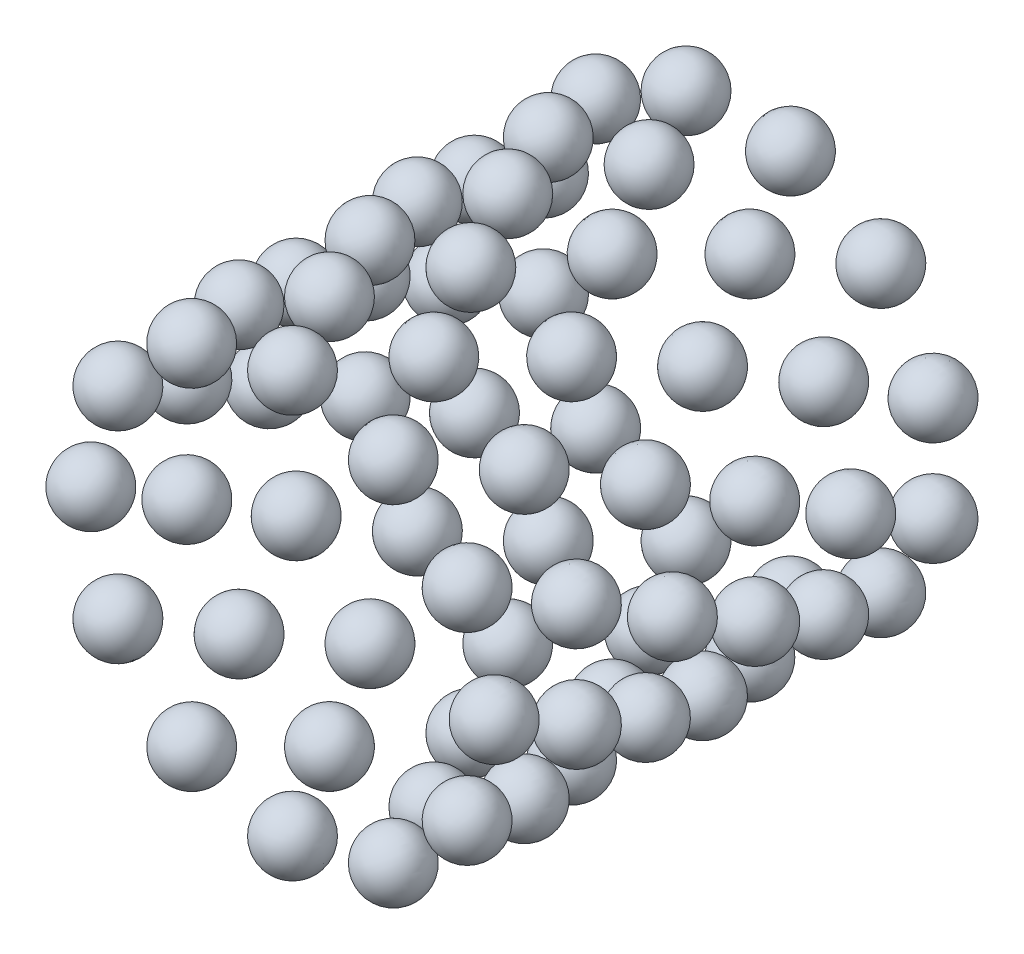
ISO-10303-21;
HEADER;
FILE_DESCRIPTION(('STEP AP214'),'2;1');
FILE_NAME('part.step','',(''),(''),'','','');
FILE_SCHEMA(('AUTOMOTIVE_DESIGN { 1 0 10303 214 1 1 1 1 }'));
ENDSEC;
DATA;
#1=APPLICATION_CONTEXT('core data for automotive mechanical design processes');
#2=APPLICATION_PROTOCOL_DEFINITION('international standard','automotive_design',2000,#1);
#3=PRODUCT_CONTEXT('',#1,'mechanical');
#4=PRODUCT('Part','Part','',(#3));
#5=PRODUCT_RELATED_PRODUCT_CATEGORY('part','',(#4));
#6=PRODUCT_DEFINITION_FORMATION('','',#4);
#7=PRODUCT_DEFINITION_CONTEXT('part definition',#1,'design');
#8=PRODUCT_DEFINITION('design','',#6,#7);
#9=PRODUCT_DEFINITION_SHAPE('','',#8);
#10=(LENGTH_UNIT() NAMED_UNIT(*) SI_UNIT(.MILLI.,.METRE.));
#11=(NAMED_UNIT(*) PLANE_ANGLE_UNIT() SI_UNIT($,.RADIAN.));
#12=(NAMED_UNIT(*) SI_UNIT($,.STERADIAN.) SOLID_ANGLE_UNIT());
#13=UNCERTAINTY_MEASURE_WITH_UNIT(LENGTH_MEASURE(1.E-05),#10,'distance_accuracy_value','');
#14=(GEOMETRIC_REPRESENTATION_CONTEXT(3) GLOBAL_UNCERTAINTY_ASSIGNED_CONTEXT((#13)) GLOBAL_UNIT_ASSIGNED_CONTEXT((#10,
#11,#12)) REPRESENTATION_CONTEXT('',''));
#15=CARTESIAN_POINT('',(0.,0.,0.));
#16=DIRECTION('',(0.,0.,1.));
#17=DIRECTION('',(1.,0.,0.));
#18=AXIS2_PLACEMENT_3D('',#15,#16,#17);
#19=CARTESIAN_POINT('',(-8.22724133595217,-4.75,-8.4));
#20=DIRECTION('',(-0.866025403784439,-0.5,0.));
#21=DIRECTION('',(0.5,-0.866025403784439,0.));
#22=AXIS2_PLACEMENT_3D('',#19,#20,#21);
#23=SPHERICAL_SURFACE('',#22,1.5);
#24=CARTESIAN_POINT('',(-9.52627944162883,-5.5,-8.4));
#25=VERTEX_POINT('',#24);
#26=VERTEX_LOOP('',#25);
#27=FACE_BOUND('',#26,.T.);
#28=CARTESIAN_POINT('',(-6.92820323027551,-4.,-8.4));
#29=VERTEX_POINT('',#28);
#30=VERTEX_LOOP('',#29);
#31=FACE_BOUND('',#30,.T.);
#32=ADVANCED_FACE('P0_F16',(#27,#31),#23,.T.);
#33=CLOSED_SHELL('',(#32));
#34=MANIFOLD_SOLID_BREP('P0_B1',#33);
#35=CARTESIAN_POINT('',(8.22724133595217,-4.75,0.));
#36=DIRECTION('',(0.866025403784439,-0.5,0.));
#37=DIRECTION('',(0.5,0.866025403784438,0.));
#38=AXIS2_PLACEMENT_3D('',#35,#36,#37);
#39=SPHERICAL_SURFACE('',#38,1.5);
#40=CARTESIAN_POINT('',(9.52627944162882,-5.5,0.));
#41=VERTEX_POINT('',#40);
#42=VERTEX_LOOP('',#41);
#43=FACE_BOUND('',#42,.T.);
#44=CARTESIAN_POINT('',(6.92820323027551,-4.,0.));
#45=VERTEX_POINT('',#44);
#46=VERTEX_LOOP('',#45);
#47=FACE_BOUND('',#46,.T.);
#48=ADVANCED_FACE('P1_F16',(#43,#47),#39,.T.);
#49=CLOSED_SHELL('',(#48));
#50=MANIFOLD_SOLID_BREP('P1_B1',#49);
#51=CARTESIAN_POINT('',(-9.5,0.,-16.8));
#52=DIRECTION('',(-1.,0.,0.));
#53=DIRECTION('',(0.,-1.,0.));
#54=AXIS2_PLACEMENT_3D('',#51,#52,#53);
#55=SPHERICAL_SURFACE('',#54,1.5);
#56=CARTESIAN_POINT('',(-11.,0.,-16.8));
#57=VERTEX_POINT('',#56);
#58=VERTEX_LOOP('',#57);
#59=FACE_BOUND('',#58,.T.);
#60=CARTESIAN_POINT('',(-8.,0.,-16.8));
#61=VERTEX_POINT('',#60);
#62=VERTEX_LOOP('',#61);
#63=FACE_BOUND('',#62,.T.);
#64=ADVANCED_FACE('P2_F16',(#59,#63),#55,.T.);
#65=CLOSED_SHELL('',(#64));
#66=MANIFOLD_SOLID_BREP('P2_B1',#65);
#67=CARTESIAN_POINT('',(-8.22724133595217,4.75,-16.8));
#68=DIRECTION('',(-0.866025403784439,0.5,0.));
#69=DIRECTION('',(-0.5,-0.866025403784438,0.));
#70=AXIS2_PLACEMENT_3D('',#67,#68,#69);
#71=SPHERICAL_SURFACE('',#70,1.5);
#72=CARTESIAN_POINT('',(-9.52627944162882,5.5,-16.8));
#73=VERTEX_POINT('',#72);
#74=VERTEX_LOOP('',#73);
#75=FACE_BOUND('',#74,.T.);
#76=CARTESIAN_POINT('',(-6.92820323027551,4.,-16.8));
#77=VERTEX_POINT('',#76);
#78=VERTEX_LOOP('',#77);
#79=FACE_BOUND('',#78,.T.);
#80=ADVANCED_FACE('P3_F16',(#75,#79),#71,.T.);
#81=CLOSED_SHELL('',(#80));
#82=MANIFOLD_SOLID_BREP('P3_B1',#81);
#83=CARTESIAN_POINT('',(0.,9.5,-16.8));
#84=DIRECTION('',(0.,1.,0.));
#85=DIRECTION('',(-1.,0.,0.));
#86=AXIS2_PLACEMENT_3D('',#83,#84,#85);
#87=SPHERICAL_SURFACE('',#86,1.5);
#88=CARTESIAN_POINT('',(0.,11.,-16.8));
#89=VERTEX_POINT('',#88);
#90=VERTEX_LOOP('',#89);
#91=FACE_BOUND('',#90,.T.);
#92=CARTESIAN_POINT('',(0.,8.,-16.8));
#93=VERTEX_POINT('',#92);
#94=VERTEX_LOOP('',#93);
#95=FACE_BOUND('',#94,.T.);
#96=ADVANCED_FACE('P4_F16',(#91,#95),#87,.T.);
#97=CLOSED_SHELL('',(#96));
#98=MANIFOLD_SOLID_BREP('P4_B1',#97);
#99=CARTESIAN_POINT('',(-9.5,0.,-8.4));
#100=DIRECTION('',(-1.,0.,0.));
#101=DIRECTION('',(0.,-1.,0.));
#102=AXIS2_PLACEMENT_3D('',#99,#100,#101);
#103=SPHERICAL_SURFACE('',#102,1.5);
#104=CARTESIAN_POINT('',(-11.,0.,-8.4));
#105=VERTEX_POINT('',#104);
#106=VERTEX_LOOP('',#105);
#107=FACE_BOUND('',#106,.T.);
#108=CARTESIAN_POINT('',(-8.,0.,-8.4));
#109=VERTEX_POINT('',#108);
#110=VERTEX_LOOP('',#109);
#111=FACE_BOUND('',#110,.T.);
#112=ADVANCED_FACE('P5_F16',(#107,#111),#103,.T.);
#113=CLOSED_SHELL('',(#112));
#114=MANIFOLD_SOLID_BREP('P5_B1',#113);
#115=CARTESIAN_POINT('',(4.75,8.22724133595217,-16.8));
#116=DIRECTION('',(0.5,0.866025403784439,0.));
#117=DIRECTION('',(-0.866025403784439,0.5,0.));
#118=AXIS2_PLACEMENT_3D('',#115,#116,#117);
#119=SPHERICAL_SURFACE('',#118,1.5);
#120=CARTESIAN_POINT('',(5.5,9.52627944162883,-16.8));
#121=VERTEX_POINT('',#120);
#122=VERTEX_LOOP('',#121);
#123=FACE_BOUND('',#122,.T.);
#124=CARTESIAN_POINT('',(4.,6.92820323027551,-16.8));
#125=VERTEX_POINT('',#124);
#126=VERTEX_LOOP('',#125);
#127=FACE_BOUND('',#126,.T.);
#128=ADVANCED_FACE('P6_F16',(#123,#127),#119,.T.);
#129=CLOSED_SHELL('',(#128));
#130=MANIFOLD_SOLID_BREP('P6_B1',#129);
#131=CARTESIAN_POINT('',(-2.45878092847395,-9.17629534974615,-21.));
#132=DIRECTION('',(-0.5,-0.866025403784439,0.));
#133=DIRECTION('',(0.866025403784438,-0.5,0.));
#134=AXIS2_PLACEMENT_3D('',#131,#132,#133);
#135=SPHERICAL_SURFACE('',#134,1.5);
#136=CARTESIAN_POINT('',(-3.20878092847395,-10.4753334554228,-21.));
#137=VERTEX_POINT('',#136);
#138=VERTEX_LOOP('',#137);
#139=FACE_BOUND('',#138,.T.);
#140=CARTESIAN_POINT('',(-1.70878092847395,-7.87725724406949,-21.));
#141=VERTEX_POINT('',#140);
#142=VERTEX_LOOP('',#141);
#143=FACE_BOUND('',#142,.T.);
#144=ADVANCED_FACE('P7_F16',(#139,#143),#135,.T.);
#145=CLOSED_SHELL('',(#144));
#146=MANIFOLD_SOLID_BREP('P7_B1',#145);
#147=CARTESIAN_POINT('',(6.7175144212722,6.7175144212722,-21.));
#148=DIRECTION('',(0.866025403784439,0.5,0.));
#149=DIRECTION('',(-0.5,0.866025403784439,0.));
#150=AXIS2_PLACEMENT_3D('',#147,#148,#149);
#151=SPHERICAL_SURFACE('',#150,1.5);
#152=CARTESIAN_POINT('',(8.01655252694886,7.46751442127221,-21.));
#153=VERTEX_POINT('',#152);
#154=VERTEX_LOOP('',#153);
#155=FACE_BOUND('',#154,.T.);
#156=CARTESIAN_POINT('',(5.41847631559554,5.96751442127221,-21.));
#157=VERTEX_POINT('',#156);
#158=VERTEX_LOOP('',#157);
#159=FACE_BOUND('',#158,.T.);
#160=ADVANCED_FACE('P8_F16',(#155,#159),#151,.T.);
#161=CLOSED_SHELL('',(#160));
#162=MANIFOLD_SOLID_BREP('P8_B1',#161);
#163=CARTESIAN_POINT('',(-8.22724133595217,-4.75,0.));
#164=DIRECTION('',(-0.866025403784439,-0.5,0.));
#165=DIRECTION('',(0.5,-0.866025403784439,0.));
#166=AXIS2_PLACEMENT_3D('',#163,#164,#165);
#167=SPHERICAL_SURFACE('',#166,1.5);
#168=CARTESIAN_POINT('',(-9.52627944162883,-5.5,0.));
#169=VERTEX_POINT('',#168);
#170=VERTEX_LOOP('',#169);
#171=FACE_BOUND('',#170,.T.);
#172=CARTESIAN_POINT('',(-6.92820323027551,-4.,0.));
#173=VERTEX_POINT('',#172);
#174=VERTEX_LOOP('',#173);
#175=FACE_BOUND('',#174,.T.);
#176=ADVANCED_FACE('P9_F16',(#171,#175),#167,.T.);
#177=CLOSED_SHELL('',(#176));
#178=MANIFOLD_SOLID_BREP('P9_B1',#177);
#179=CARTESIAN_POINT('',(6.7175144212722,-6.71751442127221,-12.6));
#180=DIRECTION('',(0.499999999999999,-0.866025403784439,0.));
#181=DIRECTION('',(0.866025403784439,0.499999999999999,0.));
#182=AXIS2_PLACEMENT_3D('',#179,#180,#181);
#183=SPHERICAL_SURFACE('',#182,1.5);
#184=CARTESIAN_POINT('',(7.4675144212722,-8.01655252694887,-12.6));
#185=VERTEX_POINT('',#184);
#186=VERTEX_LOOP('',#185);
#187=FACE_BOUND('',#186,.T.);
#188=CARTESIAN_POINT('',(5.9675144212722,-5.41847631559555,-12.6));
#189=VERTEX_POINT('',#188);
#190=VERTEX_LOOP('',#189);
#191=FACE_BOUND('',#190,.T.);
#192=ADVANCED_FACE('P10_F16',(#187,#191),#183,.T.);
#193=CLOSED_SHELL('',(#192));
#194=MANIFOLD_SOLID_BREP('P10_B1',#193);
#195=CARTESIAN_POINT('',(8.22724133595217,4.75,-16.8));
#196=DIRECTION('',(0.866025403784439,0.5,0.));
#197=DIRECTION('',(-0.5,0.866025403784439,0.));
#198=AXIS2_PLACEMENT_3D('',#195,#196,#197);
#199=SPHERICAL_SURFACE('',#198,1.5);
#200=CARTESIAN_POINT('',(9.52627944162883,5.5,-16.8));
#201=VERTEX_POINT('',#200);
#202=VERTEX_LOOP('',#201);
#203=FACE_BOUND('',#202,.T.);
#204=CARTESIAN_POINT('',(6.92820323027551,4.,-16.8));
#205=VERTEX_POINT('',#204);
#206=VERTEX_LOOP('',#205);
#207=FACE_BOUND('',#206,.T.);
#208=ADVANCED_FACE('P11_F16',(#203,#207),#199,.T.);
#209=CLOSED_SHELL('',(#208));
#210=MANIFOLD_SOLID_BREP('P11_B1',#209);
#211=CARTESIAN_POINT('',(0.,-9.5,-16.8));
#212=DIRECTION('',(0.,-1.,0.));
#213=DIRECTION('',(1.,0.,0.));
#214=AXIS2_PLACEMENT_3D('',#211,#212,#213);
#215=SPHERICAL_SURFACE('',#214,1.5);
#216=CARTESIAN_POINT('',(0.,-11.,-16.8));
#217=VERTEX_POINT('',#216);
#218=VERTEX_LOOP('',#217);
#219=FACE_BOUND('',#218,.T.);
#220=CARTESIAN_POINT('',(0.,-8.,-16.8));
#221=VERTEX_POINT('',#220);
#222=VERTEX_LOOP('',#221);
#223=FACE_BOUND('',#222,.T.);
#224=ADVANCED_FACE('P12_F16',(#219,#223),#215,.T.);
#225=CLOSED_SHELL('',(#224));
#226=MANIFOLD_SOLID_BREP('P12_B1',#225);
#227=CARTESIAN_POINT('',(2.45878092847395,-9.17629534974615,-4.2));
#228=DIRECTION('',(0.,-1.,0.));
#229=DIRECTION('',(1.,0.,0.));
#230=AXIS2_PLACEMENT_3D('',#227,#228,#229);
#231=SPHERICAL_SURFACE('',#230,1.5);
#232=CARTESIAN_POINT('',(2.45878092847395,-10.6762953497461,-4.2));
#233=VERTEX_POINT('',#232);
#234=VERTEX_LOOP('',#233);
#235=FACE_BOUND('',#234,.T.);
#236=CARTESIAN_POINT('',(2.45878092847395,-7.67629534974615,-4.2));
#237=VERTEX_POINT('',#236);
#238=VERTEX_LOOP('',#237);
#239=FACE_BOUND('',#238,.T.);
#240=ADVANCED_FACE('P13_F16',(#235,#239),#231,.T.);
#241=CLOSED_SHELL('',(#240));
#242=MANIFOLD_SOLID_BREP('P13_B1',#241);
#243=CARTESIAN_POINT('',(-9.17629534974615,-2.45878092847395,-4.2));
#244=DIRECTION('',(-1.,0.,0.));
#245=DIRECTION('',(0.,-1.,0.));
#246=AXIS2_PLACEMENT_3D('',#243,#244,#245);
#247=SPHERICAL_SURFACE('',#246,1.5);
#248=CARTESIAN_POINT('',(-10.6762953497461,-2.45878092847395,-4.2));
#249=VERTEX_POINT('',#248);
#250=VERTEX_LOOP('',#249);
#251=FACE_BOUND('',#250,.T.);
#252=CARTESIAN_POINT('',(-7.67629534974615,-2.45878092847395,-4.2));
#253=VERTEX_POINT('',#252);
#254=VERTEX_LOOP('',#253);
#255=FACE_BOUND('',#254,.T.);
#256=ADVANCED_FACE('P14_F16',(#251,#255),#247,.T.);
#257=CLOSED_SHELL('',(#256));
#258=MANIFOLD_SOLID_BREP('P14_B1',#257);
#259=CARTESIAN_POINT('',(9.17629534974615,-2.45878092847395,-12.6));
#260=DIRECTION('',(0.866025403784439,-0.5,0.));
#261=DIRECTION('',(0.5,0.866025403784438,0.));
#262=AXIS2_PLACEMENT_3D('',#259,#260,#261);
#263=SPHERICAL_SURFACE('',#262,1.5);
#264=CARTESIAN_POINT('',(10.4753334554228,-3.20878092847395,-12.6));
#265=VERTEX_POINT('',#264);
#266=VERTEX_LOOP('',#265);
#267=FACE_BOUND('',#266,.T.);
#268=CARTESIAN_POINT('',(7.87725724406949,-1.70878092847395,-12.6));
#269=VERTEX_POINT('',#268);
#270=VERTEX_LOOP('',#269);
#271=FACE_BOUND('',#270,.T.);
#272=ADVANCED_FACE('P15_F16',(#267,#271),#263,.T.);
#273=CLOSED_SHELL('',(#272));
#274=MANIFOLD_SOLID_BREP('P15_B1',#273);
#275=CARTESIAN_POINT('',(9.17629534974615,2.45878092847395,-21.));
#276=DIRECTION('',(1.,0.,0.));
#277=DIRECTION('',(0.,1.,0.));
#278=AXIS2_PLACEMENT_3D('',#275,#276,#277);
#279=SPHERICAL_SURFACE('',#278,1.5);
#280=CARTESIAN_POINT('',(10.6762953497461,2.45878092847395,-21.));
#281=VERTEX_POINT('',#280);
#282=VERTEX_LOOP('',#281);
#283=FACE_BOUND('',#282,.T.);
#284=CARTESIAN_POINT('',(7.67629534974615,2.45878092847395,-21.));
#285=VERTEX_POINT('',#284);
#286=VERTEX_LOOP('',#285);
#287=FACE_BOUND('',#286,.T.);
#288=ADVANCED_FACE('P16_F16',(#283,#287),#279,.T.);
#289=CLOSED_SHELL('',(#288));
#290=MANIFOLD_SOLID_BREP('P16_B1',#289);
#291=CARTESIAN_POINT('',(4.75,-8.22724133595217,0.));
#292=DIRECTION('',(0.499999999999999,-0.866025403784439,0.));
#293=DIRECTION('',(0.866025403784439,0.499999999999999,0.));
#294=AXIS2_PLACEMENT_3D('',#291,#292,#293);
#295=SPHERICAL_SURFACE('',#294,1.5);
#296=CARTESIAN_POINT('',(5.49999999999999,-9.52627944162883,0.));
#297=VERTEX_POINT('',#296);
#298=VERTEX_LOOP('',#297);
#299=FACE_BOUND('',#298,.T.);
#300=CARTESIAN_POINT('',(4.,-6.92820323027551,0.));
#301=VERTEX_POINT('',#300);
#302=VERTEX_LOOP('',#301);
#303=FACE_BOUND('',#302,.T.);
#304=ADVANCED_FACE('P17_F16',(#299,#303),#295,.T.);
#305=CLOSED_SHELL('',(#304));
#306=MANIFOLD_SOLID_BREP('P17_B1',#305);
#307=CARTESIAN_POINT('',(-4.75,-8.22724133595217,-16.8));
#308=DIRECTION('',(-0.5,-0.866025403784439,0.));
#309=DIRECTION('',(0.866025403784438,-0.5,0.));
#310=AXIS2_PLACEMENT_3D('',#307,#308,#309);
#311=SPHERICAL_SURFACE('',#310,1.5);
#312=CARTESIAN_POINT('',(-5.5,-9.52627944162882,-16.8));
#313=VERTEX_POINT('',#312);
#314=VERTEX_LOOP('',#313);
#315=FACE_BOUND('',#314,.T.);
#316=CARTESIAN_POINT('',(-4.,-6.92820323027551,-16.8));
#317=VERTEX_POINT('',#316);
#318=VERTEX_LOOP('',#317);
#319=FACE_BOUND('',#318,.T.);
#320=ADVANCED_FACE('P18_F16',(#315,#319),#311,.T.);
#321=CLOSED_SHELL('',(#320));
#322=MANIFOLD_SOLID_BREP('P18_B1',#321);
#323=CARTESIAN_POINT('',(9.17629534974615,-2.45878092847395,-21.));
#324=DIRECTION('',(0.866025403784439,-0.5,0.));
#325=DIRECTION('',(0.5,0.866025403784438,0.));
#326=AXIS2_PLACEMENT_3D('',#323,#324,#325);
#327=SPHERICAL_SURFACE('',#326,1.5);
#328=CARTESIAN_POINT('',(10.4753334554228,-3.20878092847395,-21.));
#329=VERTEX_POINT('',#328);
#330=VERTEX_LOOP('',#329);
#331=FACE_BOUND('',#330,.T.);
#332=CARTESIAN_POINT('',(7.87725724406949,-1.70878092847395,-21.));
#333=VERTEX_POINT('',#332);
#334=VERTEX_LOOP('',#333);
#335=FACE_BOUND('',#334,.T.);
#336=ADVANCED_FACE('P19_F16',(#331,#335),#327,.T.);
#337=CLOSED_SHELL('',(#336));
#338=MANIFOLD_SOLID_BREP('P19_B1',#337);
#339=CARTESIAN_POINT('',(-4.75,-8.22724133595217,0.));
#340=DIRECTION('',(-0.5,-0.866025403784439,0.));
#341=DIRECTION('',(0.866025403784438,-0.5,0.));
#342=AXIS2_PLACEMENT_3D('',#339,#340,#341);
#343=SPHERICAL_SURFACE('',#342,1.5);
#344=CARTESIAN_POINT('',(-5.5,-9.52627944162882,0.));
#345=VERTEX_POINT('',#344);
#346=VERTEX_LOOP('',#345);
#347=FACE_BOUND('',#346,.T.);
#348=CARTESIAN_POINT('',(-4.,-6.92820323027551,0.));
#349=VERTEX_POINT('',#348);
#350=VERTEX_LOOP('',#349);
#351=FACE_BOUND('',#350,.T.);
#352=ADVANCED_FACE('P20_F16',(#347,#351),#343,.T.);
#353=CLOSED_SHELL('',(#352));
#354=MANIFOLD_SOLID_BREP('P20_B1',#353);
#355=CARTESIAN_POINT('',(2.45878092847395,9.17629534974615,-4.2));
#356=DIRECTION('',(0.5,0.866025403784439,0.));
#357=DIRECTION('',(-0.866025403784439,0.5,0.));
#358=AXIS2_PLACEMENT_3D('',#355,#356,#357);
#359=SPHERICAL_SURFACE('',#358,1.5);
#360=CARTESIAN_POINT('',(3.20878092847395,10.4753334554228,-4.2));
#361=VERTEX_POINT('',#360);
#362=VERTEX_LOOP('',#361);
#363=FACE_BOUND('',#362,.T.);
#364=CARTESIAN_POINT('',(1.70878092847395,7.87725724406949,-4.2));
#365=VERTEX_POINT('',#364);
#366=VERTEX_LOOP('',#365);
#367=FACE_BOUND('',#366,.T.);
#368=ADVANCED_FACE('P21_F16',(#363,#367),#359,.T.);
#369=CLOSED_SHELL('',(#368));
#370=MANIFOLD_SOLID_BREP('P21_B1',#369);
#371=CARTESIAN_POINT('',(-2.45878092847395,9.17629534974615,-12.6));
#372=DIRECTION('',(0.,1.,0.));
#373=DIRECTION('',(-1.,0.,0.));
#374=AXIS2_PLACEMENT_3D('',#371,#372,#373);
#375=SPHERICAL_SURFACE('',#374,1.5);
#376=CARTESIAN_POINT('',(-2.45878092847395,10.6762953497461,-12.6));
#377=VERTEX_POINT('',#376);
#378=VERTEX_LOOP('',#377);
#379=FACE_BOUND('',#378,.T.);
#380=CARTESIAN_POINT('',(-2.45878092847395,7.67629534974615,-12.6));
#381=VERTEX_POINT('',#380);
#382=VERTEX_LOOP('',#381);
#383=FACE_BOUND('',#382,.T.);
#384=ADVANCED_FACE('P22_F16',(#379,#383),#375,.T.);
#385=CLOSED_SHELL('',(#384));
#386=MANIFOLD_SOLID_BREP('P22_B1',#385);
#387=CARTESIAN_POINT('',(-4.75,-8.22724133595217,-8.4));
#388=DIRECTION('',(-0.5,-0.866025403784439,0.));
#389=DIRECTION('',(0.866025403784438,-0.5,0.));
#390=AXIS2_PLACEMENT_3D('',#387,#388,#389);
#391=SPHERICAL_SURFACE('',#390,1.5);
#392=CARTESIAN_POINT('',(-5.5,-9.52627944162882,-8.4));
#393=VERTEX_POINT('',#392);
#394=VERTEX_LOOP('',#393);
#395=FACE_BOUND('',#394,.T.);
#396=CARTESIAN_POINT('',(-4.,-6.92820323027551,-8.4));
#397=VERTEX_POINT('',#396);
#398=VERTEX_LOOP('',#397);
#399=FACE_BOUND('',#398,.T.);
#400=ADVANCED_FACE('P23_F16',(#395,#399),#391,.T.);
#401=CLOSED_SHELL('',(#400));
#402=MANIFOLD_SOLID_BREP('P23_B1',#401);
#403=CARTESIAN_POINT('',(-6.7175144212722,-6.7175144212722,-21.));
#404=DIRECTION('',(-0.866025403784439,-0.5,0.));
#405=DIRECTION('',(0.5,-0.866025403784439,0.));
#406=AXIS2_PLACEMENT_3D('',#403,#404,#405);
#407=SPHERICAL_SURFACE('',#406,1.5);
#408=CARTESIAN_POINT('',(-8.01655252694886,-7.4675144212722,-21.));
#409=VERTEX_POINT('',#408);
#410=VERTEX_LOOP('',#409);
#411=FACE_BOUND('',#410,.T.);
#412=CARTESIAN_POINT('',(-5.41847631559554,-5.9675144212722,-21.));
#413=VERTEX_POINT('',#412);
#414=VERTEX_LOOP('',#413);
#415=FACE_BOUND('',#414,.T.);
#416=ADVANCED_FACE('P24_F16',(#411,#415),#407,.T.);
#417=CLOSED_SHELL('',(#416));
#418=MANIFOLD_SOLID_BREP('P24_B1',#417);
#419=CARTESIAN_POINT('',(2.45878092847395,-9.17629534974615,-21.));
#420=DIRECTION('',(0.,-1.,0.));
#421=DIRECTION('',(1.,0.,0.));
#422=AXIS2_PLACEMENT_3D('',#419,#420,#421);
#423=SPHERICAL_SURFACE('',#422,1.5);
#424=CARTESIAN_POINT('',(2.45878092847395,-10.6762953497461,-21.));
#425=VERTEX_POINT('',#424);
#426=VERTEX_LOOP('',#425);
#427=FACE_BOUND('',#426,.T.);
#428=CARTESIAN_POINT('',(2.45878092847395,-7.67629534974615,-21.));
#429=VERTEX_POINT('',#428);
#430=VERTEX_LOOP('',#429);
#431=FACE_BOUND('',#430,.T.);
#432=ADVANCED_FACE('P25_F16',(#427,#431),#423,.T.);
#433=CLOSED_SHELL('',(#432));
#434=MANIFOLD_SOLID_BREP('P25_B1',#433);
#435=CARTESIAN_POINT('',(-2.45878092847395,-9.17629534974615,-4.2));
#436=DIRECTION('',(-0.5,-0.866025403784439,0.));
#437=DIRECTION('',(0.866025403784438,-0.5,0.));
#438=AXIS2_PLACEMENT_3D('',#435,#436,#437);
#439=SPHERICAL_SURFACE('',#438,1.5);
#440=CARTESIAN_POINT('',(-3.20878092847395,-10.4753334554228,-4.2));
#441=VERTEX_POINT('',#440);
#442=VERTEX_LOOP('',#441);
#443=FACE_BOUND('',#442,.T.);
#444=CARTESIAN_POINT('',(-1.70878092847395,-7.87725724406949,-4.2));
#445=VERTEX_POINT('',#444);
#446=VERTEX_LOOP('',#445);
#447=FACE_BOUND('',#446,.T.);
#448=ADVANCED_FACE('P26_F16',(#443,#447),#439,.T.);
#449=CLOSED_SHELL('',(#448));
#450=MANIFOLD_SOLID_BREP('P26_B1',#449);
#451=CARTESIAN_POINT('',(8.22724133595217,-4.75,-16.8));
#452=DIRECTION('',(0.866025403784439,-0.5,0.));
#453=DIRECTION('',(0.5,0.866025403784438,0.));
#454=AXIS2_PLACEMENT_3D('',#451,#452,#453);
#455=SPHERICAL_SURFACE('',#454,1.5);
#456=CARTESIAN_POINT('',(9.52627944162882,-5.5,-16.8));
#457=VERTEX_POINT('',#456);
#458=VERTEX_LOOP('',#457);
#459=FACE_BOUND('',#458,.T.);
#460=CARTESIAN_POINT('',(6.92820323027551,-4.,-16.8));
#461=VERTEX_POINT('',#460);
#462=VERTEX_LOOP('',#461);
#463=FACE_BOUND('',#462,.T.);
#464=ADVANCED_FACE('P27_F16',(#459,#463),#455,.T.);
#465=CLOSED_SHELL('',(#464));
#466=MANIFOLD_SOLID_BREP('P27_B1',#465);
#467=CARTESIAN_POINT('',(9.5,0.,-16.8));
#468=DIRECTION('',(1.,0.,0.));
#469=DIRECTION('',(0.,1.,0.));
#470=AXIS2_PLACEMENT_3D('',#467,#468,#469);
#471=SPHERICAL_SURFACE('',#470,1.5);
#472=CARTESIAN_POINT('',(11.,0.,-16.8));
#473=VERTEX_POINT('',#472);
#474=VERTEX_LOOP('',#473);
#475=FACE_BOUND('',#474,.T.);
#476=CARTESIAN_POINT('',(8.,0.,-16.8));
#477=VERTEX_POINT('',#476);
#478=VERTEX_LOOP('',#477);
#479=FACE_BOUND('',#478,.T.);
#480=ADVANCED_FACE('P28_F16',(#475,#479),#471,.T.);
#481=CLOSED_SHELL('',(#480));
#482=MANIFOLD_SOLID_BREP('P28_B1',#481);
#483=CARTESIAN_POINT('',(-6.7175144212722,-6.7175144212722,-4.2));
#484=DIRECTION('',(-0.866025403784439,-0.5,0.));
#485=DIRECTION('',(0.5,-0.866025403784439,0.));
#486=AXIS2_PLACEMENT_3D('',#483,#484,#485);
#487=SPHERICAL_SURFACE('',#486,1.5);
#488=CARTESIAN_POINT('',(-8.01655252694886,-7.4675144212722,-4.2));
#489=VERTEX_POINT('',#488);
#490=VERTEX_LOOP('',#489);
#491=FACE_BOUND('',#490,.T.);
#492=CARTESIAN_POINT('',(-5.41847631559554,-5.9675144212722,-4.2));
#493=VERTEX_POINT('',#492);
#494=VERTEX_LOOP('',#493);
#495=FACE_BOUND('',#494,.T.);
#496=ADVANCED_FACE('P29_F16',(#491,#495),#487,.T.);
#497=CLOSED_SHELL('',(#496));
#498=MANIFOLD_SOLID_BREP('P29_B1',#497);
#499=CARTESIAN_POINT('',(8.22724133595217,4.75,-8.4));
#500=DIRECTION('',(0.866025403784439,0.5,0.));
#501=DIRECTION('',(-0.5,0.866025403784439,0.));
#502=AXIS2_PLACEMENT_3D('',#499,#500,#501);
#503=SPHERICAL_SURFACE('',#502,1.5);
#504=CARTESIAN_POINT('',(9.52627944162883,5.5,-8.4));
#505=VERTEX_POINT('',#504);
#506=VERTEX_LOOP('',#505);
#507=FACE_BOUND('',#506,.T.);
#508=CARTESIAN_POINT('',(6.92820323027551,4.,-8.4));
#509=VERTEX_POINT('',#508);
#510=VERTEX_LOOP('',#509);
#511=FACE_BOUND('',#510,.T.);
#512=ADVANCED_FACE('P30_F16',(#507,#511),#503,.T.);
#513=CLOSED_SHELL('',(#512));
#514=MANIFOLD_SOLID_BREP('P30_B1',#513);
#515=CARTESIAN_POINT('',(-6.7175144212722,6.7175144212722,-4.2));
#516=DIRECTION('',(-0.5,0.866025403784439,0.));
#517=DIRECTION('',(-0.866025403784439,-0.5,0.));
#518=AXIS2_PLACEMENT_3D('',#515,#516,#517);
#519=SPHERICAL_SURFACE('',#518,1.5);
#520=CARTESIAN_POINT('',(-7.4675144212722,8.01655252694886,-4.2));
#521=VERTEX_POINT('',#520);
#522=VERTEX_LOOP('',#521);
#523=FACE_BOUND('',#522,.T.);
#524=CARTESIAN_POINT('',(-5.9675144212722,5.41847631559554,-4.2));
#525=VERTEX_POINT('',#524);
#526=VERTEX_LOOP('',#525);
#527=FACE_BOUND('',#526,.T.);
#528=ADVANCED_FACE('P31_F16',(#523,#527),#519,.T.);
#529=CLOSED_SHELL('',(#528));
#530=MANIFOLD_SOLID_BREP('P31_B1',#529);
#531=CARTESIAN_POINT('',(0.,-9.5,0.));
#532=DIRECTION('',(0.,-1.,0.));
#533=DIRECTION('',(1.,0.,0.));
#534=AXIS2_PLACEMENT_3D('',#531,#532,#533);
#535=SPHERICAL_SURFACE('',#534,1.5);
#536=CARTESIAN_POINT('',(0.,-11.,0.));
#537=VERTEX_POINT('',#536);
#538=VERTEX_LOOP('',#537);
#539=FACE_BOUND('',#538,.T.);
#540=CARTESIAN_POINT('',(0.,-8.,0.));
#541=VERTEX_POINT('',#540);
#542=VERTEX_LOOP('',#541);
#543=FACE_BOUND('',#542,.T.);
#544=ADVANCED_FACE('P32_F16',(#539,#543),#535,.T.);
#545=CLOSED_SHELL('',(#544));
#546=MANIFOLD_SOLID_BREP('P32_B1',#545);
#547=CARTESIAN_POINT('',(-9.17629534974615,-2.45878092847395,-12.6));
#548=DIRECTION('',(-1.,0.,0.));
#549=DIRECTION('',(0.,-1.,0.));
#550=AXIS2_PLACEMENT_3D('',#547,#548,#549);
#551=SPHERICAL_SURFACE('',#550,1.5);
#552=CARTESIAN_POINT('',(-10.6762953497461,-2.45878092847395,-12.6));
#553=VERTEX_POINT('',#552);
#554=VERTEX_LOOP('',#553);
#555=FACE_BOUND('',#554,.T.);
#556=CARTESIAN_POINT('',(-7.67629534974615,-2.45878092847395,-12.6));
#557=VERTEX_POINT('',#556);
#558=VERTEX_LOOP('',#557);
#559=FACE_BOUND('',#558,.T.);
#560=ADVANCED_FACE('P33_F16',(#555,#559),#551,.T.);
#561=CLOSED_SHELL('',(#560));
#562=MANIFOLD_SOLID_BREP('P33_B1',#561);
#563=CARTESIAN_POINT('',(-9.17629534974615,-2.45878092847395,-21.));
#564=DIRECTION('',(-1.,0.,0.));
#565=DIRECTION('',(0.,-1.,0.));
#566=AXIS2_PLACEMENT_3D('',#563,#564,#565);
#567=SPHERICAL_SURFACE('',#566,1.5);
#568=CARTESIAN_POINT('',(-10.6762953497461,-2.45878092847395,-21.));
#569=VERTEX_POINT('',#568);
#570=VERTEX_LOOP('',#569);
#571=FACE_BOUND('',#570,.T.);
#572=CARTESIAN_POINT('',(-7.67629534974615,-2.45878092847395,-21.));
#573=VERTEX_POINT('',#572);
#574=VERTEX_LOOP('',#573);
#575=FACE_BOUND('',#574,.T.);
#576=ADVANCED_FACE('P34_F16',(#571,#575),#567,.T.);
#577=CLOSED_SHELL('',(#576));
#578=MANIFOLD_SOLID_BREP('P34_B1',#577);
#579=CARTESIAN_POINT('',(9.17629534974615,2.45878092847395,-4.2));
#580=DIRECTION('',(1.,0.,0.));
#581=DIRECTION('',(0.,1.,0.));
#582=AXIS2_PLACEMENT_3D('',#579,#580,#581);
#583=SPHERICAL_SURFACE('',#582,1.5);
#584=CARTESIAN_POINT('',(10.6762953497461,2.45878092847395,-4.2));
#585=VERTEX_POINT('',#584);
#586=VERTEX_LOOP('',#585);
#587=FACE_BOUND('',#586,.T.);
#588=CARTESIAN_POINT('',(7.67629534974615,2.45878092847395,-4.2));
#589=VERTEX_POINT('',#588);
#590=VERTEX_LOOP('',#589);
#591=FACE_BOUND('',#590,.T.);
#592=ADVANCED_FACE('P35_F16',(#587,#591),#583,.T.);
#593=CLOSED_SHELL('',(#592));
#594=MANIFOLD_SOLID_BREP('P35_B1',#593);
#595=CARTESIAN_POINT('',(9.5,0.,0.));
#596=DIRECTION('',(1.,0.,0.));
#597=DIRECTION('',(0.,1.,0.));
#598=AXIS2_PLACEMENT_3D('',#595,#596,#597);
#599=SPHERICAL_SURFACE('',#598,1.5);
#600=CARTESIAN_POINT('',(11.,0.,0.));
#601=VERTEX_POINT('',#600);
#602=VERTEX_LOOP('',#601);
#603=FACE_BOUND('',#602,.T.);
#604=CARTESIAN_POINT('',(8.,0.,0.));
#605=VERTEX_POINT('',#604);
#606=VERTEX_LOOP('',#605);
#607=FACE_BOUND('',#606,.T.);
#608=ADVANCED_FACE('P36_F16',(#603,#607),#599,.T.);
#609=CLOSED_SHELL('',(#608));
#610=MANIFOLD_SOLID_BREP('P36_B1',#609);
#611=CARTESIAN_POINT('',(0.,-9.5,-8.4));
#612=DIRECTION('',(0.,-1.,0.));
#613=DIRECTION('',(1.,0.,0.));
#614=AXIS2_PLACEMENT_3D('',#611,#612,#613);
#615=SPHERICAL_SURFACE('',#614,1.5);
#616=CARTESIAN_POINT('',(0.,-11.,-8.4));
#617=VERTEX_POINT('',#616);
#618=VERTEX_LOOP('',#617);
#619=FACE_BOUND('',#618,.T.);
#620=CARTESIAN_POINT('',(0.,-8.,-8.4));
#621=VERTEX_POINT('',#620);
#622=VERTEX_LOOP('',#621);
#623=FACE_BOUND('',#622,.T.);
#624=ADVANCED_FACE('P37_F16',(#619,#623),#615,.T.);
#625=CLOSED_SHELL('',(#624));
#626=MANIFOLD_SOLID_BREP('P37_B1',#625);
#627=CARTESIAN_POINT('',(-4.75,8.22724133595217,-8.4));
#628=DIRECTION('',(-0.5,0.866025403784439,0.));
#629=DIRECTION('',(-0.866025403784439,-0.5,0.));
#630=AXIS2_PLACEMENT_3D('',#627,#628,#629);
#631=SPHERICAL_SURFACE('',#630,1.5);
#632=CARTESIAN_POINT('',(-5.5,9.52627944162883,-8.4));
#633=VERTEX_POINT('',#632);
#634=VERTEX_LOOP('',#633);
#635=FACE_BOUND('',#634,.T.);
#636=CARTESIAN_POINT('',(-4.,6.92820323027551,-8.4));
#637=VERTEX_POINT('',#636);
#638=VERTEX_LOOP('',#637);
#639=FACE_BOUND('',#638,.T.);
#640=ADVANCED_FACE('P38_F16',(#635,#639),#631,.T.);
#641=CLOSED_SHELL('',(#640));
#642=MANIFOLD_SOLID_BREP('P38_B1',#641);
#643=CARTESIAN_POINT('',(-6.7175144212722,-6.7175144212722,-12.6));
#644=DIRECTION('',(-0.866025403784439,-0.5,0.));
#645=DIRECTION('',(0.5,-0.866025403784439,0.));
#646=AXIS2_PLACEMENT_3D('',#643,#644,#645);
#647=SPHERICAL_SURFACE('',#646,1.5);
#648=CARTESIAN_POINT('',(-8.01655252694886,-7.4675144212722,-12.6));
#649=VERTEX_POINT('',#648);
#650=VERTEX_LOOP('',#649);
#651=FACE_BOUND('',#650,.T.);
#652=CARTESIAN_POINT('',(-5.41847631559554,-5.9675144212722,-12.6));
#653=VERTEX_POINT('',#652);
#654=VERTEX_LOOP('',#653);
#655=FACE_BOUND('',#654,.T.);
#656=ADVANCED_FACE('P39_F16',(#651,#655),#647,.T.);
#657=CLOSED_SHELL('',(#656));
#658=MANIFOLD_SOLID_BREP('P39_B1',#657);
#659=CARTESIAN_POINT('',(-2.45878092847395,9.17629534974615,-21.));
#660=DIRECTION('',(0.,1.,0.));
#661=DIRECTION('',(-1.,0.,0.));
#662=AXIS2_PLACEMENT_3D('',#659,#660,#661);
#663=SPHERICAL_SURFACE('',#662,1.5);
#664=CARTESIAN_POINT('',(-2.45878092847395,10.6762953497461,-21.));
#665=VERTEX_POINT('',#664);
#666=VERTEX_LOOP('',#665);
#667=FACE_BOUND('',#666,.T.);
#668=CARTESIAN_POINT('',(-2.45878092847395,7.67629534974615,-21.));
#669=VERTEX_POINT('',#668);
#670=VERTEX_LOOP('',#669);
#671=FACE_BOUND('',#670,.T.);
#672=ADVANCED_FACE('P40_F16',(#667,#671),#663,.T.);
#673=CLOSED_SHELL('',(#672));
#674=MANIFOLD_SOLID_BREP('P40_B1',#673);
#675=CARTESIAN_POINT('',(4.75,-8.22724133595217,-16.8));
#676=DIRECTION('',(0.499999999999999,-0.866025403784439,0.));
#677=DIRECTION('',(0.866025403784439,0.499999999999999,0.));
#678=AXIS2_PLACEMENT_3D('',#675,#676,#677);
#679=SPHERICAL_SURFACE('',#678,1.5);
#680=CARTESIAN_POINT('',(5.49999999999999,-9.52627944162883,-16.8));
#681=VERTEX_POINT('',#680);
#682=VERTEX_LOOP('',#681);
#683=FACE_BOUND('',#682,.T.);
#684=CARTESIAN_POINT('',(4.,-6.92820323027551,-16.8));
#685=VERTEX_POINT('',#684);
#686=VERTEX_LOOP('',#685);
#687=FACE_BOUND('',#686,.T.);
#688=ADVANCED_FACE('P41_F16',(#683,#687),#679,.T.);
#689=CLOSED_SHELL('',(#688));
#690=MANIFOLD_SOLID_BREP('P41_B1',#689);
#691=CARTESIAN_POINT('',(2.45878092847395,-9.17629534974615,-12.6));
#692=DIRECTION('',(0.,-1.,0.));
#693=DIRECTION('',(1.,0.,0.));
#694=AXIS2_PLACEMENT_3D('',#691,#692,#693);
#695=SPHERICAL_SURFACE('',#694,1.5);
#696=CARTESIAN_POINT('',(2.45878092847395,-10.6762953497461,-12.6));
#697=VERTEX_POINT('',#696);
#698=VERTEX_LOOP('',#697);
#699=FACE_BOUND('',#698,.T.);
#700=CARTESIAN_POINT('',(2.45878092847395,-7.67629534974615,-12.6));
#701=VERTEX_POINT('',#700);
#702=VERTEX_LOOP('',#701);
#703=FACE_BOUND('',#702,.T.);
#704=ADVANCED_FACE('P42_F16',(#699,#703),#695,.T.);
#705=CLOSED_SHELL('',(#704));
#706=MANIFOLD_SOLID_BREP('P42_B1',#705);
#707=CARTESIAN_POINT('',(8.22724133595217,4.75,0.));
#708=DIRECTION('',(0.866025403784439,0.5,0.));
#709=DIRECTION('',(-0.5,0.866025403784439,0.));
#710=AXIS2_PLACEMENT_3D('',#707,#708,#709);
#711=SPHERICAL_SURFACE('',#710,1.5);
#712=CARTESIAN_POINT('',(9.52627944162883,5.5,0.));
#713=VERTEX_POINT('',#712);
#714=VERTEX_LOOP('',#713);
#715=FACE_BOUND('',#714,.T.);
#716=CARTESIAN_POINT('',(6.92820323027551,4.,0.));
#717=VERTEX_POINT('',#716);
#718=VERTEX_LOOP('',#717);
#719=FACE_BOUND('',#718,.T.);
#720=ADVANCED_FACE('P43_F16',(#715,#719),#711,.T.);
#721=CLOSED_SHELL('',(#720));
#722=MANIFOLD_SOLID_BREP('P43_B1',#721);
#723=CARTESIAN_POINT('',(0.,9.5,-8.4));
#724=DIRECTION('',(0.,1.,0.));
#725=DIRECTION('',(-1.,0.,0.));
#726=AXIS2_PLACEMENT_3D('',#723,#724,#725);
#727=SPHERICAL_SURFACE('',#726,1.5);
#728=CARTESIAN_POINT('',(0.,11.,-8.4));
#729=VERTEX_POINT('',#728);
#730=VERTEX_LOOP('',#729);
#731=FACE_BOUND('',#730,.T.);
#732=CARTESIAN_POINT('',(0.,8.,-8.4));
#733=VERTEX_POINT('',#732);
#734=VERTEX_LOOP('',#733);
#735=FACE_BOUND('',#734,.T.);
#736=ADVANCED_FACE('P44_F16',(#731,#735),#727,.T.);
#737=CLOSED_SHELL('',(#736));
#738=MANIFOLD_SOLID_BREP('P44_B1',#737);
#739=CARTESIAN_POINT('',(-2.45878092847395,-9.17629534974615,-12.6));
#740=DIRECTION('',(-0.5,-0.866025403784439,0.));
#741=DIRECTION('',(0.866025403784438,-0.5,0.));
#742=AXIS2_PLACEMENT_3D('',#739,#740,#741);
#743=SPHERICAL_SURFACE('',#742,1.5);
#744=CARTESIAN_POINT('',(-3.20878092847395,-10.4753334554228,-12.6));
#745=VERTEX_POINT('',#744);
#746=VERTEX_LOOP('',#745);
#747=FACE_BOUND('',#746,.T.);
#748=CARTESIAN_POINT('',(-1.70878092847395,-7.87725724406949,-12.6));
#749=VERTEX_POINT('',#748);
#750=VERTEX_LOOP('',#749);
#751=FACE_BOUND('',#750,.T.);
#752=ADVANCED_FACE('P45_F16',(#747,#751),#743,.T.);
#753=CLOSED_SHELL('',(#752));
#754=MANIFOLD_SOLID_BREP('P45_B1',#753);
#755=CARTESIAN_POINT('',(2.45878092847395,9.17629534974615,-12.6));
#756=DIRECTION('',(0.5,0.866025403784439,0.));
#757=DIRECTION('',(-0.866025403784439,0.5,0.));
#758=AXIS2_PLACEMENT_3D('',#755,#756,#757);
#759=SPHERICAL_SURFACE('',#758,1.5);
#760=CARTESIAN_POINT('',(3.20878092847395,10.4753334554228,-12.6));
#761=VERTEX_POINT('',#760);
#762=VERTEX_LOOP('',#761);
#763=FACE_BOUND('',#762,.T.);
#764=CARTESIAN_POINT('',(1.70878092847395,7.87725724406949,-12.6));
#765=VERTEX_POINT('',#764);
#766=VERTEX_LOOP('',#765);
#767=FACE_BOUND('',#766,.T.);
#768=ADVANCED_FACE('P46_F16',(#763,#767),#759,.T.);
#769=CLOSED_SHELL('',(#768));
#770=MANIFOLD_SOLID_BREP('P46_B1',#769);
#771=CARTESIAN_POINT('',(8.22724133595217,-4.75,-8.4));
#772=DIRECTION('',(0.866025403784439,-0.5,0.));
#773=DIRECTION('',(0.5,0.866025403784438,0.));
#774=AXIS2_PLACEMENT_3D('',#771,#772,#773);
#775=SPHERICAL_SURFACE('',#774,1.5);
#776=CARTESIAN_POINT('',(9.52627944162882,-5.5,-8.4));
#777=VERTEX_POINT('',#776);
#778=VERTEX_LOOP('',#777);
#779=FACE_BOUND('',#778,.T.);
#780=CARTESIAN_POINT('',(6.92820323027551,-4.,-8.4));
#781=VERTEX_POINT('',#780);
#782=VERTEX_LOOP('',#781);
#783=FACE_BOUND('',#782,.T.);
#784=ADVANCED_FACE('P47_F16',(#779,#783),#775,.T.);
#785=CLOSED_SHELL('',(#784));
#786=MANIFOLD_SOLID_BREP('P47_B1',#785);
#787=CARTESIAN_POINT('',(-8.22724133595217,4.75,-8.4));
#788=DIRECTION('',(-0.866025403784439,0.5,0.));
#789=DIRECTION('',(-0.5,-0.866025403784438,0.));
#790=AXIS2_PLACEMENT_3D('',#787,#788,#789);
#791=SPHERICAL_SURFACE('',#790,1.5);
#792=CARTESIAN_POINT('',(-9.52627944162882,5.5,-8.4));
#793=VERTEX_POINT('',#792);
#794=VERTEX_LOOP('',#793);
#795=FACE_BOUND('',#794,.T.);
#796=CARTESIAN_POINT('',(-6.92820323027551,4.,-8.4));
#797=VERTEX_POINT('',#796);
#798=VERTEX_LOOP('',#797);
#799=FACE_BOUND('',#798,.T.);
#800=ADVANCED_FACE('P48_F16',(#795,#799),#791,.T.);
#801=CLOSED_SHELL('',(#800));
#802=MANIFOLD_SOLID_BREP('P48_B1',#801);
#803=CARTESIAN_POINT('',(4.75,8.22724133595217,0.));
#804=DIRECTION('',(0.5,0.866025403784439,0.));
#805=DIRECTION('',(-0.866025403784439,0.5,0.));
#806=AXIS2_PLACEMENT_3D('',#803,#804,#805);
#807=SPHERICAL_SURFACE('',#806,1.5);
#808=CARTESIAN_POINT('',(5.5,9.52627944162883,0.));
#809=VERTEX_POINT('',#808);
#810=VERTEX_LOOP('',#809);
#811=FACE_BOUND('',#810,.T.);
#812=CARTESIAN_POINT('',(4.,6.92820323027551,0.));
#813=VERTEX_POINT('',#812);
#814=VERTEX_LOOP('',#813);
#815=FACE_BOUND('',#814,.T.);
#816=ADVANCED_FACE('P49_F16',(#811,#815),#807,.T.);
#817=CLOSED_SHELL('',(#816));
#818=MANIFOLD_SOLID_BREP('P49_B1',#817);
#819=CARTESIAN_POINT('',(-6.7175144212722,6.7175144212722,-12.6));
#820=DIRECTION('',(-0.5,0.866025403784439,0.));
#821=DIRECTION('',(-0.866025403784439,-0.5,0.));
#822=AXIS2_PLACEMENT_3D('',#819,#820,#821);
#823=SPHERICAL_SURFACE('',#822,1.5);
#824=CARTESIAN_POINT('',(-7.4675144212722,8.01655252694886,-12.6));
#825=VERTEX_POINT('',#824);
#826=VERTEX_LOOP('',#825);
#827=FACE_BOUND('',#826,.T.);
#828=CARTESIAN_POINT('',(-5.9675144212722,5.41847631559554,-12.6));
#829=VERTEX_POINT('',#828);
#830=VERTEX_LOOP('',#829);
#831=FACE_BOUND('',#830,.T.);
#832=ADVANCED_FACE('P50_F16',(#827,#831),#823,.T.);
#833=CLOSED_SHELL('',(#832));
#834=MANIFOLD_SOLID_BREP('P50_B1',#833);
#835=CARTESIAN_POINT('',(9.17629534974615,2.45878092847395,-12.6));
#836=DIRECTION('',(1.,0.,0.));
#837=DIRECTION('',(0.,1.,0.));
#838=AXIS2_PLACEMENT_3D('',#835,#836,#837);
#839=SPHERICAL_SURFACE('',#838,1.5);
#840=CARTESIAN_POINT('',(10.6762953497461,2.45878092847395,-12.6));
#841=VERTEX_POINT('',#840);
#842=VERTEX_LOOP('',#841);
#843=FACE_BOUND('',#842,.T.);
#844=CARTESIAN_POINT('',(7.67629534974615,2.45878092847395,-12.6));
#845=VERTEX_POINT('',#844);
#846=VERTEX_LOOP('',#845);
#847=FACE_BOUND('',#846,.T.);
#848=ADVANCED_FACE('P51_F16',(#843,#847),#839,.T.);
#849=CLOSED_SHELL('',(#848));
#850=MANIFOLD_SOLID_BREP('P51_B1',#849);
#851=CARTESIAN_POINT('',(0.,9.5,0.));
#852=DIRECTION('',(0.,1.,0.));
#853=DIRECTION('',(-1.,0.,0.));
#854=AXIS2_PLACEMENT_3D('',#851,#852,#853);
#855=SPHERICAL_SURFACE('',#854,1.5);
#856=CARTESIAN_POINT('',(0.,11.,0.));
#857=VERTEX_POINT('',#856);
#858=VERTEX_LOOP('',#857);
#859=FACE_BOUND('',#858,.T.);
#860=CARTESIAN_POINT('',(0.,8.,0.));
#861=VERTEX_POINT('',#860);
#862=VERTEX_LOOP('',#861);
#863=FACE_BOUND('',#862,.T.);
#864=ADVANCED_FACE('P52_F16',(#859,#863),#855,.T.);
#865=CLOSED_SHELL('',(#864));
#866=MANIFOLD_SOLID_BREP('P52_B1',#865);
#867=CARTESIAN_POINT('',(6.7175144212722,-6.71751442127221,-21.));
#868=DIRECTION('',(0.499999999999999,-0.866025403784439,0.));
#869=DIRECTION('',(0.866025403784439,0.499999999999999,0.));
#870=AXIS2_PLACEMENT_3D('',#867,#868,#869);
#871=SPHERICAL_SURFACE('',#870,1.5);
#872=CARTESIAN_POINT('',(7.4675144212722,-8.01655252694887,-21.));
#873=VERTEX_POINT('',#872);
#874=VERTEX_LOOP('',#873);
#875=FACE_BOUND('',#874,.T.);
#876=CARTESIAN_POINT('',(5.9675144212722,-5.41847631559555,-21.));
#877=VERTEX_POINT('',#876);
#878=VERTEX_LOOP('',#877);
#879=FACE_BOUND('',#878,.T.);
#880=ADVANCED_FACE('P53_F16',(#875,#879),#871,.T.);
#881=CLOSED_SHELL('',(#880));
#882=MANIFOLD_SOLID_BREP('P53_B1',#881);
#883=CARTESIAN_POINT('',(-4.75,8.22724133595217,0.));
#884=DIRECTION('',(-0.5,0.866025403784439,0.));
#885=DIRECTION('',(-0.866025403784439,-0.5,0.));
#886=AXIS2_PLACEMENT_3D('',#883,#884,#885);
#887=SPHERICAL_SURFACE('',#886,1.5);
#888=CARTESIAN_POINT('',(-5.5,9.52627944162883,0.));
#889=VERTEX_POINT('',#888);
#890=VERTEX_LOOP('',#889);
#891=FACE_BOUND('',#890,.T.);
#892=CARTESIAN_POINT('',(-4.,6.92820323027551,0.));
#893=VERTEX_POINT('',#892);
#894=VERTEX_LOOP('',#893);
#895=FACE_BOUND('',#894,.T.);
#896=ADVANCED_FACE('P54_F16',(#891,#895),#887,.T.);
#897=CLOSED_SHELL('',(#896));
#898=MANIFOLD_SOLID_BREP('P54_B1',#897);
#899=CARTESIAN_POINT('',(-6.7175144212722,6.7175144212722,-21.));
#900=DIRECTION('',(-0.5,0.866025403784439,0.));
#901=DIRECTION('',(-0.866025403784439,-0.5,0.));
#902=AXIS2_PLACEMENT_3D('',#899,#900,#901);
#903=SPHERICAL_SURFACE('',#902,1.5);
#904=CARTESIAN_POINT('',(-7.4675144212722,8.01655252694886,-21.));
#905=VERTEX_POINT('',#904);
#906=VERTEX_LOOP('',#905);
#907=FACE_BOUND('',#906,.T.);
#908=CARTESIAN_POINT('',(-5.9675144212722,5.41847631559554,-21.));
#909=VERTEX_POINT('',#908);
#910=VERTEX_LOOP('',#909);
#911=FACE_BOUND('',#910,.T.);
#912=ADVANCED_FACE('P55_F16',(#907,#911),#903,.T.);
#913=CLOSED_SHELL('',(#912));
#914=MANIFOLD_SOLID_BREP('P55_B1',#913);
#915=CARTESIAN_POINT('',(-8.22724133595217,-4.75,-16.8));
#916=DIRECTION('',(-0.866025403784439,-0.5,0.));
#917=DIRECTION('',(0.5,-0.866025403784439,0.));
#918=AXIS2_PLACEMENT_3D('',#915,#916,#917);
#919=SPHERICAL_SURFACE('',#918,1.5);
#920=CARTESIAN_POINT('',(-9.52627944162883,-5.5,-16.8));
#921=VERTEX_POINT('',#920);
#922=VERTEX_LOOP('',#921);
#923=FACE_BOUND('',#922,.T.);
#924=CARTESIAN_POINT('',(-6.92820323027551,-4.,-16.8));
#925=VERTEX_POINT('',#924);
#926=VERTEX_LOOP('',#925);
#927=FACE_BOUND('',#926,.T.);
#928=ADVANCED_FACE('P56_F16',(#923,#927),#919,.T.);
#929=CLOSED_SHELL('',(#928));
#930=MANIFOLD_SOLID_BREP('P56_B1',#929);
#931=CARTESIAN_POINT('',(9.17629534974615,-2.45878092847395,-4.2));
#932=DIRECTION('',(0.866025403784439,-0.5,0.));
#933=DIRECTION('',(0.5,0.866025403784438,0.));
#934=AXIS2_PLACEMENT_3D('',#931,#932,#933);
#935=SPHERICAL_SURFACE('',#934,1.5);
#936=CARTESIAN_POINT('',(10.4753334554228,-3.20878092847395,-4.2));
#937=VERTEX_POINT('',#936);
#938=VERTEX_LOOP('',#937);
#939=FACE_BOUND('',#938,.T.);
#940=CARTESIAN_POINT('',(7.87725724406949,-1.70878092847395,-4.2));
#941=VERTEX_POINT('',#940);
#942=VERTEX_LOOP('',#941);
#943=FACE_BOUND('',#942,.T.);
#944=ADVANCED_FACE('P57_F16',(#939,#943),#935,.T.);
#945=CLOSED_SHELL('',(#944));
#946=MANIFOLD_SOLID_BREP('P57_B1',#945);
#947=CARTESIAN_POINT('',(4.75,-8.22724133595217,-8.4));
#948=DIRECTION('',(0.499999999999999,-0.866025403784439,0.));
#949=DIRECTION('',(0.866025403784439,0.499999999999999,0.));
#950=AXIS2_PLACEMENT_3D('',#947,#948,#949);
#951=SPHERICAL_SURFACE('',#950,1.5);
#952=CARTESIAN_POINT('',(5.49999999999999,-9.52627944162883,-8.4));
#953=VERTEX_POINT('',#952);
#954=VERTEX_LOOP('',#953);
#955=FACE_BOUND('',#954,.T.);
#956=CARTESIAN_POINT('',(4.,-6.92820323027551,-8.4));
#957=VERTEX_POINT('',#956);
#958=VERTEX_LOOP('',#957);
#959=FACE_BOUND('',#958,.T.);
#960=ADVANCED_FACE('P58_F16',(#955,#959),#951,.T.);
#961=CLOSED_SHELL('',(#960));
#962=MANIFOLD_SOLID_BREP('P58_B1',#961);
#963=CARTESIAN_POINT('',(6.7175144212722,-6.71751442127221,-4.2));
#964=DIRECTION('',(0.499999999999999,-0.866025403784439,0.));
#965=DIRECTION('',(0.866025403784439,0.499999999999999,0.));
#966=AXIS2_PLACEMENT_3D('',#963,#964,#965);
#967=SPHERICAL_SURFACE('',#966,1.5);
#968=CARTESIAN_POINT('',(7.4675144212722,-8.01655252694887,-4.2));
#969=VERTEX_POINT('',#968);
#970=VERTEX_LOOP('',#969);
#971=FACE_BOUND('',#970,.T.);
#972=CARTESIAN_POINT('',(5.9675144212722,-5.41847631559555,-4.2));
#973=VERTEX_POINT('',#972);
#974=VERTEX_LOOP('',#973);
#975=FACE_BOUND('',#974,.T.);
#976=ADVANCED_FACE('P59_F16',(#971,#975),#967,.T.);
#977=CLOSED_SHELL('',(#976));
#978=MANIFOLD_SOLID_BREP('P59_B1',#977);
#979=CARTESIAN_POINT('',(4.75,8.22724133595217,-8.4));
#980=DIRECTION('',(0.5,0.866025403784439,0.));
#981=DIRECTION('',(-0.866025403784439,0.5,0.));
#982=AXIS2_PLACEMENT_3D('',#979,#980,#981);
#983=SPHERICAL_SURFACE('',#982,1.5);
#984=CARTESIAN_POINT('',(5.5,9.52627944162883,-8.4));
#985=VERTEX_POINT('',#984);
#986=VERTEX_LOOP('',#985);
#987=FACE_BOUND('',#986,.T.);
#988=CARTESIAN_POINT('',(4.,6.92820323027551,-8.4));
#989=VERTEX_POINT('',#988);
#990=VERTEX_LOOP('',#989);
#991=FACE_BOUND('',#990,.T.);
#992=ADVANCED_FACE('P60_F16',(#987,#991),#983,.T.);
#993=CLOSED_SHELL('',(#992));
#994=MANIFOLD_SOLID_BREP('P60_B1',#993);
#995=CARTESIAN_POINT('',(-9.17629534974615,2.45878092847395,-4.2));
#996=DIRECTION('',(-0.866025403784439,0.5,0.));
#997=DIRECTION('',(-0.5,-0.866025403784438,0.));
#998=AXIS2_PLACEMENT_3D('',#995,#996,#997);
#999=SPHERICAL_SURFACE('',#998,1.5);
#1000=CARTESIAN_POINT('',(-10.4753334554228,3.20878092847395,-4.2));
#1001=VERTEX_POINT('',#1000);
#1002=VERTEX_LOOP('',#1001);
#1003=FACE_BOUND('',#1002,.T.);
#1004=CARTESIAN_POINT('',(-7.87725724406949,1.70878092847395,-4.2));
#1005=VERTEX_POINT('',#1004);
#1006=VERTEX_LOOP('',#1005);
#1007=FACE_BOUND('',#1006,.T.);
#1008=ADVANCED_FACE('P61_F16',(#1003,#1007),#999,.T.);
#1009=CLOSED_SHELL('',(#1008));
#1010=MANIFOLD_SOLID_BREP('P61_B1',#1009);
#1011=CARTESIAN_POINT('',(9.5,0.,-8.4));
#1012=DIRECTION('',(1.,0.,0.));
#1013=DIRECTION('',(0.,1.,0.));
#1014=AXIS2_PLACEMENT_3D('',#1011,#1012,#1013);
#1015=SPHERICAL_SURFACE('',#1014,1.5);
#1016=CARTESIAN_POINT('',(11.,0.,-8.4));
#1017=VERTEX_POINT('',#1016);
#1018=VERTEX_LOOP('',#1017);
#1019=FACE_BOUND('',#1018,.T.);
#1020=CARTESIAN_POINT('',(8.,0.,-8.4));
#1021=VERTEX_POINT('',#1020);
#1022=VERTEX_LOOP('',#1021);
#1023=FACE_BOUND('',#1022,.T.);
#1024=ADVANCED_FACE('P62_F16',(#1019,#1023),#1015,.T.);
#1025=CLOSED_SHELL('',(#1024));
#1026=MANIFOLD_SOLID_BREP('P62_B1',#1025);
#1027=CARTESIAN_POINT('',(-2.45878092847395,9.17629534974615,-4.2));
#1028=DIRECTION('',(0.,1.,0.));
#1029=DIRECTION('',(-1.,0.,0.));
#1030=AXIS2_PLACEMENT_3D('',#1027,#1028,#1029);
#1031=SPHERICAL_SURFACE('',#1030,1.5);
#1032=CARTESIAN_POINT('',(-2.45878092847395,10.6762953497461,-4.2));
#1033=VERTEX_POINT('',#1032);
#1034=VERTEX_LOOP('',#1033);
#1035=FACE_BOUND('',#1034,.T.);
#1036=CARTESIAN_POINT('',(-2.45878092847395,7.67629534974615,-4.2));
#1037=VERTEX_POINT('',#1036);
#1038=VERTEX_LOOP('',#1037);
#1039=FACE_BOUND('',#1038,.T.);
#1040=ADVANCED_FACE('P63_F16',(#1035,#1039),#1031,.T.);
#1041=CLOSED_SHELL('',(#1040));
#1042=MANIFOLD_SOLID_BREP('P63_B1',#1041);
#1043=CARTESIAN_POINT('',(6.7175144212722,6.7175144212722,-12.6));
#1044=DIRECTION('',(0.866025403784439,0.5,0.));
#1045=DIRECTION('',(-0.5,0.866025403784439,0.));
#1046=AXIS2_PLACEMENT_3D('',#1043,#1044,#1045);
#1047=SPHERICAL_SURFACE('',#1046,1.5);
#1048=CARTESIAN_POINT('',(8.01655252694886,7.46751442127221,-12.6));
#1049=VERTEX_POINT('',#1048);
#1050=VERTEX_LOOP('',#1049);
#1051=FACE_BOUND('',#1050,.T.);
#1052=CARTESIAN_POINT('',(5.41847631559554,5.96751442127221,-12.6));
#1053=VERTEX_POINT('',#1052);
#1054=VERTEX_LOOP('',#1053);
#1055=FACE_BOUND('',#1054,.T.);
#1056=ADVANCED_FACE('P64_F16',(#1051,#1055),#1047,.T.);
#1057=CLOSED_SHELL('',(#1056));
#1058=MANIFOLD_SOLID_BREP('P64_B1',#1057);
#1059=CARTESIAN_POINT('',(-9.17629534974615,2.45878092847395,-21.));
#1060=DIRECTION('',(-0.866025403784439,0.5,0.));
#1061=DIRECTION('',(-0.5,-0.866025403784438,0.));
#1062=AXIS2_PLACEMENT_3D('',#1059,#1060,#1061);
#1063=SPHERICAL_SURFACE('',#1062,1.5);
#1064=CARTESIAN_POINT('',(-10.4753334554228,3.20878092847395,-21.));
#1065=VERTEX_POINT('',#1064);
#1066=VERTEX_LOOP('',#1065);
#1067=FACE_BOUND('',#1066,.T.);
#1068=CARTESIAN_POINT('',(-7.87725724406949,1.70878092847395,-21.));
#1069=VERTEX_POINT('',#1068);
#1070=VERTEX_LOOP('',#1069);
#1071=FACE_BOUND('',#1070,.T.);
#1072=ADVANCED_FACE('P65_F16',(#1067,#1071),#1063,.T.);
#1073=CLOSED_SHELL('',(#1072));
#1074=MANIFOLD_SOLID_BREP('P65_B1',#1073);
#1075=CARTESIAN_POINT('',(6.7175144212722,6.7175144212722,-4.2));
#1076=DIRECTION('',(0.866025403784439,0.5,0.));
#1077=DIRECTION('',(-0.5,0.866025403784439,0.));
#1078=AXIS2_PLACEMENT_3D('',#1075,#1076,#1077);
#1079=SPHERICAL_SURFACE('',#1078,1.5);
#1080=CARTESIAN_POINT('',(8.01655252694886,7.46751442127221,-4.2));
#1081=VERTEX_POINT('',#1080);
#1082=VERTEX_LOOP('',#1081);
#1083=FACE_BOUND('',#1082,.T.);
#1084=CARTESIAN_POINT('',(5.41847631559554,5.96751442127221,-4.2));
#1085=VERTEX_POINT('',#1084);
#1086=VERTEX_LOOP('',#1085);
#1087=FACE_BOUND('',#1086,.T.);
#1088=ADVANCED_FACE('P66_F16',(#1083,#1087),#1079,.T.);
#1089=CLOSED_SHELL('',(#1088));
#1090=MANIFOLD_SOLID_BREP('P66_B1',#1089);
#1091=CARTESIAN_POINT('',(-9.5,0.,0.));
#1092=DIRECTION('',(-1.,0.,0.));
#1093=DIRECTION('',(0.,-1.,0.));
#1094=AXIS2_PLACEMENT_3D('',#1091,#1092,#1093);
#1095=SPHERICAL_SURFACE('',#1094,1.5);
#1096=CARTESIAN_POINT('',(-11.,0.,0.));
#1097=VERTEX_POINT('',#1096);
#1098=VERTEX_LOOP('',#1097);
#1099=FACE_BOUND('',#1098,.T.);
#1100=CARTESIAN_POINT('',(-8.,0.,0.));
#1101=VERTEX_POINT('',#1100);
#1102=VERTEX_LOOP('',#1101);
#1103=FACE_BOUND('',#1102,.T.);
#1104=ADVANCED_FACE('P67_F16',(#1099,#1103),#1095,.T.);
#1105=CLOSED_SHELL('',(#1104));
#1106=MANIFOLD_SOLID_BREP('P67_B1',#1105);
#1107=CARTESIAN_POINT('',(2.45878092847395,9.17629534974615,-21.));
#1108=DIRECTION('',(0.5,0.866025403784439,0.));
#1109=DIRECTION('',(-0.866025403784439,0.5,0.));
#1110=AXIS2_PLACEMENT_3D('',#1107,#1108,#1109);
#1111=SPHERICAL_SURFACE('',#1110,1.5);
#1112=CARTESIAN_POINT('',(3.20878092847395,10.4753334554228,-21.));
#1113=VERTEX_POINT('',#1112);
#1114=VERTEX_LOOP('',#1113);
#1115=FACE_BOUND('',#1114,.T.);
#1116=CARTESIAN_POINT('',(1.70878092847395,7.87725724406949,-21.));
#1117=VERTEX_POINT('',#1116);
#1118=VERTEX_LOOP('',#1117);
#1119=FACE_BOUND('',#1118,.T.);
#1120=ADVANCED_FACE('P68_F16',(#1115,#1119),#1111,.T.);
#1121=CLOSED_SHELL('',(#1120));
#1122=MANIFOLD_SOLID_BREP('P68_B1',#1121);
#1123=CARTESIAN_POINT('',(-8.22724133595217,4.75,0.));
#1124=DIRECTION('',(-0.866025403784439,0.5,0.));
#1125=DIRECTION('',(-0.5,-0.866025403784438,0.));
#1126=AXIS2_PLACEMENT_3D('',#1123,#1124,#1125);
#1127=SPHERICAL_SURFACE('',#1126,1.5);
#1128=CARTESIAN_POINT('',(-9.52627944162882,5.5,0.));
#1129=VERTEX_POINT('',#1128);
#1130=VERTEX_LOOP('',#1129);
#1131=FACE_BOUND('',#1130,.T.);
#1132=CARTESIAN_POINT('',(-6.92820323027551,4.,0.));
#1133=VERTEX_POINT('',#1132);
#1134=VERTEX_LOOP('',#1133);
#1135=FACE_BOUND('',#1134,.T.);
#1136=ADVANCED_FACE('P69_F16',(#1131,#1135),#1127,.T.);
#1137=CLOSED_SHELL('',(#1136));
#1138=MANIFOLD_SOLID_BREP('P69_B1',#1137);
#1139=CARTESIAN_POINT('',(-9.17629534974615,2.45878092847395,-12.6));
#1140=DIRECTION('',(-0.866025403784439,0.5,0.));
#1141=DIRECTION('',(-0.5,-0.866025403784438,0.));
#1142=AXIS2_PLACEMENT_3D('',#1139,#1140,#1141);
#1143=SPHERICAL_SURFACE('',#1142,1.5);
#1144=CARTESIAN_POINT('',(-10.4753334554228,3.20878092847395,-12.6));
#1145=VERTEX_POINT('',#1144);
#1146=VERTEX_LOOP('',#1145);
#1147=FACE_BOUND('',#1146,.T.);
#1148=CARTESIAN_POINT('',(-7.87725724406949,1.70878092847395,-12.6));
#1149=VERTEX_POINT('',#1148);
#1150=VERTEX_LOOP('',#1149);
#1151=FACE_BOUND('',#1150,.T.);
#1152=ADVANCED_FACE('P70_F16',(#1147,#1151),#1143,.T.);
#1153=CLOSED_SHELL('',(#1152));
#1154=MANIFOLD_SOLID_BREP('P70_B1',#1153);
#1155=CARTESIAN_POINT('',(-4.75,8.22724133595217,-16.8));
#1156=DIRECTION('',(-0.5,0.866025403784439,0.));
#1157=DIRECTION('',(-0.866025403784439,-0.5,0.));
#1158=AXIS2_PLACEMENT_3D('',#1155,#1156,#1157);
#1159=SPHERICAL_SURFACE('',#1158,1.5);
#1160=CARTESIAN_POINT('',(-5.5,9.52627944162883,-16.8));
#1161=VERTEX_POINT('',#1160);
#1162=VERTEX_LOOP('',#1161);
#1163=FACE_BOUND('',#1162,.T.);
#1164=CARTESIAN_POINT('',(-4.,6.92820323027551,-16.8));
#1165=VERTEX_POINT('',#1164);
#1166=VERTEX_LOOP('',#1165);
#1167=FACE_BOUND('',#1166,.T.);
#1168=ADVANCED_FACE('P71_F16',(#1163,#1167),#1159,.T.);
#1169=CLOSED_SHELL('',(#1168));
#1170=MANIFOLD_SOLID_BREP('P71_B1',#1169);
#1171=ADVANCED_BREP_SHAPE_REPRESENTATION('',(#18,#34,#50,#66,#82,#98,#114,#130,#146,#162,#178,
#194,#210,#226,#242,#258,#274,#290,#306,#322,#338,#354,#370,#386,#402,#418,#434,#450,#466,#482,
#498,#514,#530,#546,#562,#578,#594,#610,#626,#642,#658,#674,#690,#706,#722,#738,#754,#770,#786,
#802,#818,#834,#850,#866,#882,#898,#914,#930,#946,#962,#978,#994,#1010,#1026,#1042,#1058,#1074,
#1090,#1106,#1122,#1138,#1154,#1170),#14);
#1172=SHAPE_DEFINITION_REPRESENTATION(#9,#1171);
ENDSEC;
END-ISO-10303-21;
